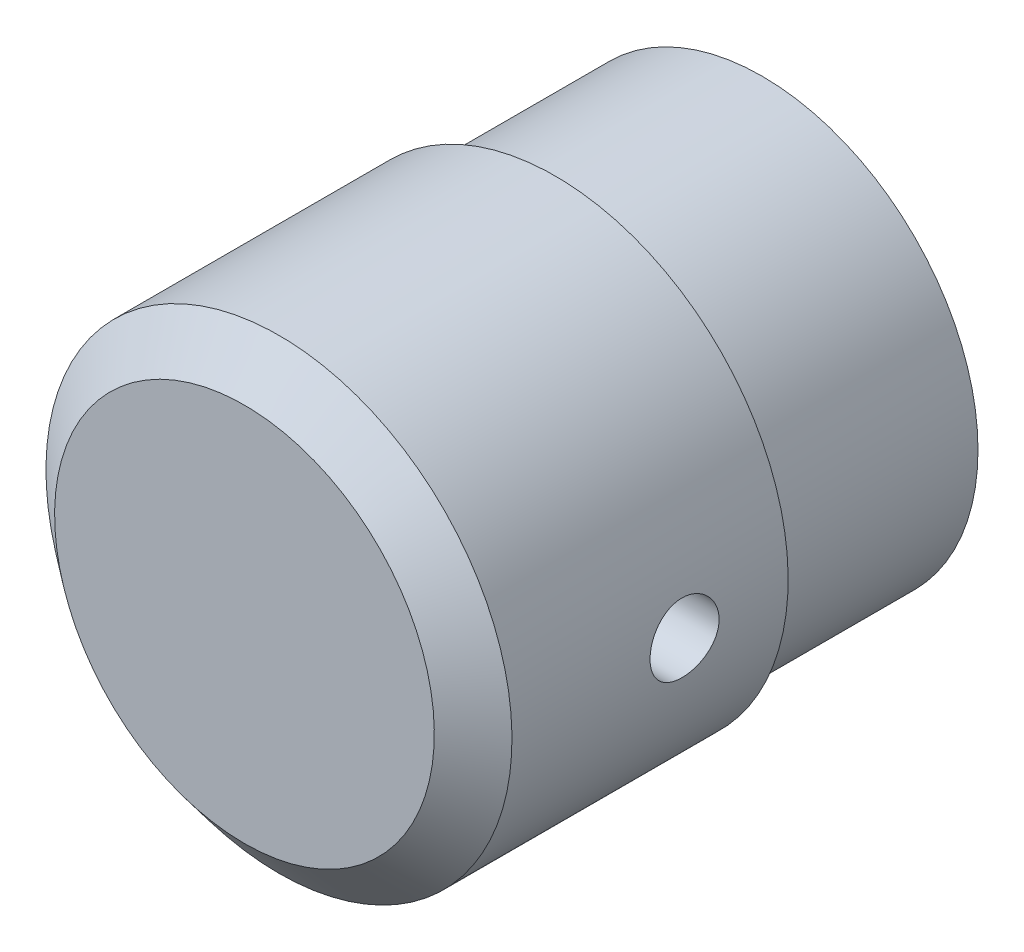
ISO-10303-21;
HEADER;
FILE_DESCRIPTION(('STEP AP214'),'2;1');
FILE_NAME('part.step','',(''),(''),'','','');
FILE_SCHEMA(('AUTOMOTIVE_DESIGN { 1 0 10303 214 1 1 1 1 }'));
ENDSEC;
DATA;
#1=APPLICATION_CONTEXT('core data for automotive mechanical design processes');
#2=APPLICATION_PROTOCOL_DEFINITION('international standard','automotive_design',2000,#1);
#3=PRODUCT_CONTEXT('',#1,'mechanical');
#4=PRODUCT('Part','Part','',(#3));
#5=PRODUCT_RELATED_PRODUCT_CATEGORY('part','',(#4));
#6=PRODUCT_DEFINITION_FORMATION('','',#4);
#7=PRODUCT_DEFINITION_CONTEXT('part definition',#1,'design');
#8=PRODUCT_DEFINITION('design','',#6,#7);
#9=PRODUCT_DEFINITION_SHAPE('','',#8);
#10=(LENGTH_UNIT() NAMED_UNIT(*) SI_UNIT(.MILLI.,.METRE.));
#11=(NAMED_UNIT(*) PLANE_ANGLE_UNIT() SI_UNIT($,.RADIAN.));
#12=(NAMED_UNIT(*) SI_UNIT($,.STERADIAN.) SOLID_ANGLE_UNIT());
#13=UNCERTAINTY_MEASURE_WITH_UNIT(LENGTH_MEASURE(1.E-05),#10,'distance_accuracy_value','');
#14=(GEOMETRIC_REPRESENTATION_CONTEXT(3) GLOBAL_UNCERTAINTY_ASSIGNED_CONTEXT((#13)) GLOBAL_UNIT_ASSIGNED_CONTEXT((#10,
#11,#12)) REPRESENTATION_CONTEXT('',''));
#15=CARTESIAN_POINT('',(0.,0.,0.));
#16=DIRECTION('',(0.,0.,1.));
#17=DIRECTION('',(1.,0.,0.));
#18=AXIS2_PLACEMENT_3D('',#15,#16,#17);
#19=CARTESIAN_POINT('',(0.,0.,-7.16785252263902));
#20=DIRECTION('',(0.,0.,-1.));
#21=DIRECTION('',(0.,-1.,0.));
#22=AXIS2_PLACEMENT_3D('',#19,#20,#21);
#23=CYLINDRICAL_SURFACE('',#22,13.5);
#24=CARTESIAN_POINT('',(0.,0.,12.));
#25=DIRECTION('',(0.,0.,-1.));
#26=DIRECTION('',(0.,-1.,0.));
#27=AXIS2_PLACEMENT_3D('',#24,#25,#26);
#28=CIRCLE('',#27,13.5);
#29=CARTESIAN_POINT('',(0.,-13.5,12.));
#30=VERTEX_POINT('',#29);
#31=EDGE_CURVE('E29',#30,#30,#28,.T.);
#32=ORIENTED_EDGE('',*,*,#31,.F.);
#33=EDGE_LOOP('',(#32));
#34=FACE_BOUND('',#33,.T.);
#35=CARTESIAN_POINT('',(0.,0.,28.));
#36=DIRECTION('',(0.,0.,-1.));
#37=DIRECTION('',(0.,-1.,0.));
#38=AXIS2_PLACEMENT_3D('',#35,#36,#37);
#39=CIRCLE('',#38,13.5);
#40=CARTESIAN_POINT('',(0.,-13.5,28.));
#41=VERTEX_POINT('',#40);
#42=EDGE_CURVE('E25',#41,#41,#39,.T.);
#43=ORIENTED_EDGE('',*,*,#42,.T.);
#44=EDGE_LOOP('',(#43));
#45=FACE_BOUND('',#44,.T.);
#46=CARTESIAN_POINT('',(13.3510299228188,2.,18.));
#47=CARTESIAN_POINT('',(13.3510317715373,1.99999537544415,17.8883225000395));
#48=CARTESIAN_POINT('',(13.3524463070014,1.99061447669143,17.7765797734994));
#49=CARTESIAN_POINT('',(13.3579479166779,1.95334804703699,17.5562173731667));
#50=CARTESIAN_POINT('',(13.3620376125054,1.9254443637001,17.447600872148));
#51=CARTESIAN_POINT('',(13.3724163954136,1.85198451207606,17.2367125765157));
#52=CARTESIAN_POINT('',(13.3787038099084,1.80644176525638,17.1344360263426));
#53=CARTESIAN_POINT('',(13.3927676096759,1.69902796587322,16.938991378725));
#54=CARTESIAN_POINT('',(13.4005437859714,1.63715920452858,16.8458220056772));
#55=CARTESIAN_POINT('',(13.4167768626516,1.49833330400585,16.6704937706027));
#56=CARTESIAN_POINT('',(13.4252381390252,1.4212737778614,16.5884163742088));
#57=CARTESIAN_POINT('',(13.4418489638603,1.2544748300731,16.4383077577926));
#58=CARTESIAN_POINT('',(13.4499984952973,1.16473471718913,16.3702773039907));
#59=CARTESIAN_POINT('',(13.4651133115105,0.974600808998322,16.2498937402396));
#60=CARTESIAN_POINT('',(13.4720728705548,0.874159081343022,16.1976155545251));
#61=CARTESIAN_POINT('',(13.4839751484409,0.665800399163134,16.1107012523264));
#62=CARTESIAN_POINT('',(13.4889179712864,0.557883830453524,16.0760642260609));
#63=CARTESIAN_POINT('',(13.4961989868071,0.338477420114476,16.0256621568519));
#64=CARTESIAN_POINT('',(13.4985559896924,0.227019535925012,16.0097607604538));
#65=CARTESIAN_POINT('',(13.500464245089,0.00299429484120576,15.996858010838));
#66=CARTESIAN_POINT('',(13.5000156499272,-0.109573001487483,15.9998556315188));
#67=CARTESIAN_POINT('',(13.4963782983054,-0.331691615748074,16.0245580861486));
#68=CARTESIAN_POINT('',(13.4932110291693,-0.441259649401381,16.0461162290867));
#69=CARTESIAN_POINT('',(13.4845161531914,-0.655205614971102,16.1070975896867));
#70=CARTESIAN_POINT('',(13.4789884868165,-0.759583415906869,16.1465212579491));
#71=CARTESIAN_POINT('',(13.4661569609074,-0.960630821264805,16.2422652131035));
#72=CARTESIAN_POINT('',(13.4588466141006,-1.05727052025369,16.2986473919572));
#73=CARTESIAN_POINT('',(13.4432647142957,-1.23977237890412,16.4266627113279));
#74=CARTESIAN_POINT('',(13.4349930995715,-1.32563384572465,16.4982968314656));
#75=CARTESIAN_POINT('',(13.4183177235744,-1.48500641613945,16.655600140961));
#76=CARTESIAN_POINT('',(13.4099134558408,-1.55839113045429,16.7413973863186));
#77=CARTESIAN_POINT('',(13.3939974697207,-1.6897405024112,16.9241560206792));
#78=CARTESIAN_POINT('',(13.3864857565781,-1.74770506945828,17.0211174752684));
#79=CARTESIAN_POINT('',(13.3732055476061,-1.84658503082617,17.2235823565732));
#80=CARTESIAN_POINT('',(13.3674383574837,-1.88748766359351,17.32909210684));
#81=CARTESIAN_POINT('',(13.3583234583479,-1.95095673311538,17.5455881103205));
#82=CARTESIAN_POINT('',(13.3549755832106,-1.97352442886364,17.6565739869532));
#83=CARTESIAN_POINT('',(13.3511097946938,-1.99951014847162,17.8797479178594));
#84=CARTESIAN_POINT('',(13.3505654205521,-2.00310723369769,17.9919146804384));
#85=CARTESIAN_POINT('',(13.3522980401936,-1.99152454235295,18.2152494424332));
#86=CARTESIAN_POINT('',(13.3545749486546,-1.9763453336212,18.3264174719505));
#87=CARTESIAN_POINT('',(13.3616692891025,-1.92779271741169,18.5440458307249));
#88=CARTESIAN_POINT('',(13.3664742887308,-1.89450831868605,18.6505264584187));
#89=CARTESIAN_POINT('',(13.3780731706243,-1.81078265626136,18.8563971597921));
#90=CARTESIAN_POINT('',(13.3848671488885,-1.76034056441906,18.9557868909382));
#91=CARTESIAN_POINT('',(13.3997409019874,-1.64330036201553,19.1454577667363));
#92=CARTESIAN_POINT('',(13.4078297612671,-1.57658621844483,19.2356665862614));
#93=CARTESIAN_POINT('',(13.4243544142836,-1.42905720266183,19.4036718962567));
#94=CARTESIAN_POINT('',(13.4327902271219,-1.34824155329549,19.4814677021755));
#95=CARTESIAN_POINT('',(13.4491408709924,-1.17401551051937,19.6230805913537));
#96=CARTESIAN_POINT('',(13.457050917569,-1.0805082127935,19.6867790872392));
#97=CARTESIAN_POINT('',(13.4713846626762,-0.884016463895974,19.7975634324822));
#98=CARTESIAN_POINT('',(13.4778084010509,-0.781032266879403,19.8446497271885));
#99=CARTESIAN_POINT('',(13.4884247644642,-0.568882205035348,19.9206830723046));
#100=CARTESIAN_POINT('',(13.4926253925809,-0.459740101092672,19.9496952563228));
#101=CARTESIAN_POINT('',(13.4983558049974,-0.238066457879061,19.9889677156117));
#102=CARTESIAN_POINT('',(13.4998857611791,-0.125535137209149,19.9992291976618));
#103=CARTESIAN_POINT('',(13.5001007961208,0.0985718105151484,20.0006800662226));
#104=CARTESIAN_POINT('',(13.4988129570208,0.210146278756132,19.9920510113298));
#105=CARTESIAN_POINT('',(13.4935916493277,0.430239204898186,19.9563545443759));
#106=CARTESIAN_POINT('',(13.4896581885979,0.538757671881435,19.9292871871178));
#107=CARTESIAN_POINT('',(13.4795855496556,0.749610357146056,19.8575462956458));
#108=CARTESIAN_POINT('',(13.4734479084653,0.851948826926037,19.8128850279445));
#109=CARTESIAN_POINT('',(13.4596414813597,1.04770796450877,19.7072433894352));
#110=CARTESIAN_POINT('',(13.4519726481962,1.1411283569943,19.646262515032));
#111=CARTESIAN_POINT('',(13.4358689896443,1.31732093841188,19.5090549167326));
#112=CARTESIAN_POINT('',(13.4274278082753,1.39998808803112,19.432694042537));
#113=CARTESIAN_POINT('',(13.4107781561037,1.55140152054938,19.2671762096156));
#114=CARTESIAN_POINT('',(13.402569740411,1.62014453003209,19.1780162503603));
#115=CARTESIAN_POINT('',(13.3872668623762,1.74209505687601,18.9888583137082));
#116=CARTESIAN_POINT('',(13.3801787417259,1.79521550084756,18.8888036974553));
#117=CARTESIAN_POINT('',(13.36799332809,1.88381847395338,18.6811354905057));
#118=CARTESIAN_POINT('',(13.3628939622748,1.91931937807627,18.5735299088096));
#119=CARTESIAN_POINT('',(13.3564464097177,1.96358296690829,18.3878624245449));
#120=CARTESIAN_POINT('',(13.3544259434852,1.97721856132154,18.3109493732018));
#121=CARTESIAN_POINT('',(13.3517170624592,1.99542863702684,18.156034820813));
#122=CARTESIAN_POINT('',(13.3510286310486,2.00000323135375,18.0780333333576));
#123=CARTESIAN_POINT('',(13.3510299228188,2.,18.));
#124=B_SPLINE_CURVE_WITH_KNOTS('',3,(#46,#47,#48,#49,#50,#51,#52,#53,#54,#55,#56,#57,#58,#59,
#60,#61,#62,#63,#64,#65,#66,#67,#68,#69,#70,#71,#72,#73,#74,#75,#76,#77,#78,#79,#80,#81,#82,#83,
#84,#85,#86,#87,#88,#89,#90,#91,#92,#93,#94,#95,#96,#97,#98,#99,#100,#101,#102,#103,#104,#105,
#106,#107,#108,#109,#110,#111,#112,#113,#114,#115,#116,#117,#118,#119,#120,#121,#122,#123),
.UNSPECIFIED.,.T.,.F.,(4,2,2,2,2,2,2,2,2,2,2,2,2,2,2,2,2,2,2,2,2,2,2,2,2,2,2,2,2,2,2,2,2,2,2,2,
2,2,4),(0.,0.334747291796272,0.669823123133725,1.00464449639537,1.33941890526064,
1.67653202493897,2.01366352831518,2.35237413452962,2.6910672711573,3.02727994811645,
3.36347437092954,3.69703585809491,4.0306057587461,4.3654081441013,4.70023204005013,
5.0382681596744,5.37630626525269,5.71459675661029,6.05286401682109,6.38793262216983,
6.7229910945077,7.0564170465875,7.38985909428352,7.72575218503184,8.06166379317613,
8.40030191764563,8.73893096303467,9.07633252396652,9.41371236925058,9.74786387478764,
10.0820143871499,10.4159323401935,10.7498605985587,11.0868385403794,11.4238956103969,
11.762797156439,12.1013445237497,12.3352481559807,12.5691488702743),.UNSPECIFIED.);
#125=CARTESIAN_POINT('',(13.3510299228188,2.,18.));
#126=VERTEX_POINT('',#125);
#127=EDGE_CURVE('E49',#126,#126,#124,.T.);
#128=ORIENTED_EDGE('',*,*,#127,.T.);
#129=EDGE_LOOP('',(#128));
#130=FACE_BOUND('',#129,.T.);
#131=ADVANCED_FACE('F12',(#34,#45,#130),#23,.T.);
#132=CARTESIAN_POINT('',(0.,0.,26.));
#133=DIRECTION('',(0.,0.,-1.));
#134=DIRECTION('',(0.,-1.,0.));
#135=AXIS2_PLACEMENT_3D('',#132,#133,#134);
#136=CYLINDRICAL_SURFACE('',#135,3.);
#137=CARTESIAN_POINT('',(0.,0.,24.));
#138=DIRECTION('',(0.,0.,-1.));
#139=DIRECTION('',(-1.,0.,0.));
#140=AXIS2_PLACEMENT_3D('',#137,#138,#139);
#141=CIRCLE('',#140,3.);
#142=CARTESIAN_POINT('',(-3.,0.,24.));
#143=VERTEX_POINT('',#142);
#144=EDGE_CURVE('E56',#143,#143,#141,.T.);
#145=ORIENTED_EDGE('',*,*,#144,.F.);
#146=EDGE_LOOP('',(#145));
#147=FACE_BOUND('',#146,.T.);
#148=CARTESIAN_POINT('',(0.,0.,12.));
#149=DIRECTION('',(0.,0.,-1.));
#150=DIRECTION('',(0.,-1.,0.));
#151=AXIS2_PLACEMENT_3D('',#148,#149,#150);
#152=CIRCLE('',#151,3.);
#153=CARTESIAN_POINT('',(0.,-3.,12.));
#154=VERTEX_POINT('',#153);
#155=EDGE_CURVE('E46',#154,#154,#152,.T.);
#156=ORIENTED_EDGE('',*,*,#155,.T.);
#157=EDGE_LOOP('',(#156));
#158=FACE_BOUND('',#157,.T.);
#159=CARTESIAN_POINT('',(2.23606797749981,2.,18.));
#160=CARTESIAN_POINT('',(2.23607753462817,1.99999453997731,17.9023716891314));
#161=CARTESIAN_POINT('',(2.24258071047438,1.99278992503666,17.8047092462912));
#162=CARTESIAN_POINT('',(2.26731972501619,1.96458268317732,17.6128800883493));
#163=CARTESIAN_POINT('',(2.28557660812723,1.9435553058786,17.5187199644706));
#164=CARTESIAN_POINT('',(2.33056585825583,1.88935861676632,17.3372645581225));
#165=CARTESIAN_POINT('',(2.35721561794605,1.85630718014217,17.2499123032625));
#166=CARTESIAN_POINT('',(2.41584094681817,1.77934008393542,17.0821341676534));
#167=CARTESIAN_POINT('',(2.4478176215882,1.73542216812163,17.0017097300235));
#168=CARTESIAN_POINT('',(2.51946072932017,1.63002410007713,16.8363531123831));
#169=CARTESIAN_POINT('',(2.55954936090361,1.56687435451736,16.7526678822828));
#170=CARTESIAN_POINT('',(2.63944827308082,1.42819219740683,16.5959972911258));
#171=CARTESIAN_POINT('',(2.6792582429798,1.35264773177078,16.5230224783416));
#172=CARTESIAN_POINT('',(2.76088818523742,1.17815690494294,16.3793563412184));
#173=CARTESIAN_POINT('',(2.80216785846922,1.07740643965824,16.3105174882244));
#174=CARTESIAN_POINT('',(2.87558484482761,0.862470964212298,16.1913579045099));
#175=CARTESIAN_POINT('',(2.90773236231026,0.74830115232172,16.1410164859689));
#176=CARTESIAN_POINT('',(2.95599907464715,0.523249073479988,16.0664435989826));
#177=CARTESIAN_POINT('',(2.97351175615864,0.413434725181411,16.0399166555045));
#178=CARTESIAN_POINT('',(2.99609745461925,0.189695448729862,16.0058155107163));
#179=CARTESIAN_POINT('',(3.00118613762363,0.0757758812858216,15.9982174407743));
#180=CARTESIAN_POINT('',(2.99855361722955,-0.134147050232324,16.0021724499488));
#181=CARTESIAN_POINT('',(2.99266264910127,-0.230240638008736,16.010989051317));
#182=CARTESIAN_POINT('',(2.97208182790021,-0.419238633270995,16.042091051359));
#183=CARTESIAN_POINT('',(2.95739133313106,-0.51214280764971,16.0643774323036));
#184=CARTESIAN_POINT('',(2.9205209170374,-0.692077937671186,16.1211956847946));
#185=CARTESIAN_POINT('',(2.89837077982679,-0.779130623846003,16.1556788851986));
#186=CARTESIAN_POINT('',(2.84821104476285,-0.946209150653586,16.2355536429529));
#187=CARTESIAN_POINT('',(2.82020037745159,-1.0262337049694,16.2809471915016));
#188=CARTESIAN_POINT('',(2.75618058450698,-1.18828429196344,16.38797873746));
#189=CARTESIAN_POINT('',(2.71960408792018,-1.26919148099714,16.4509675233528));
#190=CARTESIAN_POINT('',(2.64400601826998,-1.41998807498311,16.5878986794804));
#191=CARTESIAN_POINT('',(2.60498072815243,-1.48986013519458,16.661857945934));
#192=CARTESIAN_POINT('',(2.52150044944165,-1.62772235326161,16.8319632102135));
#193=CARTESIAN_POINT('',(2.47714320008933,-1.69373593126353,16.9297710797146));
#194=CARTESIAN_POINT('',(2.39475610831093,-1.80834874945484,17.1375098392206));
#195=CARTESIAN_POINT('',(2.35671571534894,-1.85697718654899,17.2474199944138));
#196=CARTESIAN_POINT('',(2.30262870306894,-1.92332724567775,17.444719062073));
#197=CARTESIAN_POINT('',(2.28340364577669,-1.9459079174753,17.5295933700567));
#198=CARTESIAN_POINT('',(2.25409039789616,-1.97979555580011,17.7030394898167));
#199=CARTESIAN_POINT('',(2.24398636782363,-1.99112206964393,17.7916046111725));
#200=CARTESIAN_POINT('',(2.23447556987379,-2.00179400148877,17.9704429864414));
#201=CARTESIAN_POINT('',(2.2351153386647,-2.00108729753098,18.06072197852));
#202=CARTESIAN_POINT('',(2.24709880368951,-1.98761629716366,18.239683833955));
#203=CARTESIAN_POINT('',(2.25845117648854,-1.97484222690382,18.3283653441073));
#204=CARTESIAN_POINT('',(2.28927977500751,-1.93899811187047,18.4973894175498));
#205=CARTESIAN_POINT('',(2.3083318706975,-1.91646174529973,18.5779277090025));
#206=CARTESIAN_POINT('',(2.35229958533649,-1.86223041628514,18.7341262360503));
#207=CARTESIAN_POINT('',(2.3772171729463,-1.83053237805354,18.809784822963));
#208=CARTESIAN_POINT('',(2.43611483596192,-1.75163346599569,18.9702020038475));
#209=CARTESIAN_POINT('',(2.4709108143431,-1.70260028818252,19.0537568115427));
#210=CARTESIAN_POINT('',(2.54262514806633,-1.59352731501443,19.2124168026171));
#211=CARTESIAN_POINT('',(2.57954604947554,-1.53347411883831,19.2875115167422));
#212=CARTESIAN_POINT('',(2.66075678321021,-1.38876657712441,19.4439623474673));
#213=CARTESIAN_POINT('',(2.70489452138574,-1.30160386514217,19.5231028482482));
#214=CARTESIAN_POINT('',(2.78775581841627,-1.11309948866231,19.6658166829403));
#215=CARTESIAN_POINT('',(2.82648414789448,-1.01177047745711,19.7294037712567));
#216=CARTESIAN_POINT('',(2.88790821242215,-0.817487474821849,19.8278917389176));
#217=CARTESIAN_POINT('',(2.91225458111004,-0.726662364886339,19.8659565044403));
#218=CARTESIAN_POINT('',(2.95278707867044,-0.538757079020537,19.9286071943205));
#219=CARTESIAN_POINT('',(2.96898009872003,-0.44168226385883,19.95320450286));
#220=CARTESIAN_POINT('',(2.99178364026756,-0.243369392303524,19.987696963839));
#221=CARTESIAN_POINT('',(2.99835150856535,-0.142114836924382,19.9975266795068));
#222=CARTESIAN_POINT('',(3.00109821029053,0.0608555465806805,20.001647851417));
#223=CARTESIAN_POINT('',(2.99727800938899,0.162571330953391,19.995940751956));
#224=CARTESIAN_POINT('',(2.98029555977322,0.355757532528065,19.9703405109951));
#225=CARTESIAN_POINT('',(2.96783277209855,0.447435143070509,19.9515090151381));
#226=CARTESIAN_POINT('',(2.93536106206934,0.626018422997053,19.9017619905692));
#227=CARTESIAN_POINT('',(2.91535096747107,0.712923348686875,19.8708445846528));
#228=CARTESIAN_POINT('',(2.86791765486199,0.885147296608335,19.7960612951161));
#229=CARTESIAN_POINT('',(2.84013248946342,0.970083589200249,19.751549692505));
#230=CARTESIAN_POINT('',(2.7797540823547,1.13155266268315,19.651849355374));
#231=CARTESIAN_POINT('',(2.74715796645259,1.20808037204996,19.5966542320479));
#232=CARTESIAN_POINT('',(2.67392931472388,1.36329422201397,19.4673710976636));
#233=CARTESIAN_POINT('',(2.63283913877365,1.44042679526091,19.3916769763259));
#234=CARTESIAN_POINT('',(2.55053357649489,1.58160022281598,19.2288864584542));
#235=CARTESIAN_POINT('',(2.50931811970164,1.64563128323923,19.1417816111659));
#236=CARTESIAN_POINT('',(2.43384213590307,1.7551325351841,18.9641324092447));
#237=CARTESIAN_POINT('',(2.39929086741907,1.8016464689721,18.8743581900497));
#238=CARTESIAN_POINT('',(2.33747501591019,1.88115802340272,18.6867155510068));
#239=CARTESIAN_POINT('',(2.31019631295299,1.91418190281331,18.5888633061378));
#240=CARTESIAN_POINT('',(2.27191051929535,1.95936262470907,18.4092285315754));
#241=CARTESIAN_POINT('',(2.25863695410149,1.97452228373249,18.3286917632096));
#242=CARTESIAN_POINT('',(2.2407151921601,1.99483915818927,18.1654435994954));
#243=CARTESIAN_POINT('',(2.23605987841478,2.00000462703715,18.0827340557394));
#244=CARTESIAN_POINT('',(2.23606797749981,2.,18.));
#245=B_SPLINE_CURVE_WITH_KNOTS('',3,(#159,#160,#161,#162,#163,#164,#165,#166,#167,#168,#169,
#170,#171,#172,#173,#174,#175,#176,#177,#178,#179,#180,#181,#182,#183,#184,#185,#186,#187,#188,
#189,#190,#191,#192,#193,#194,#195,#196,#197,#198,#199,#200,#201,#202,#203,#204,#205,#206,#207,
#208,#209,#210,#211,#212,#213,#214,#215,#216,#217,#218,#219,#220,#221,#222,#223,#224,#225,#226,
#227,#228,#229,#230,#231,#232,#233,#234,#235,#236,#237,#238,#239,#240,#241,#242,#243,#244),
.UNSPECIFIED.,.T.,.F.,(4,2,2,2,2,2,2,2,2,2,2,2,2,2,2,2,2,2,2,2,2,2,2,2,2,2,2,2,2,2,2,2,2,2,2,2,
2,2,2,2,2,2,4),(0.,0.292506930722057,0.585539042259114,0.875772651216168,1.16606657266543,
1.5015467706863,1.83735518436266,2.22167031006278,2.6055542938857,2.94637482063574,
3.28676536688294,3.57539534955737,3.86404638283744,4.15155831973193,4.43912276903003,
4.7644752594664,5.09033414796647,5.46678703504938,5.84260469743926,6.11126090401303,
6.37944966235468,6.6488003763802,6.91836943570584,7.17476451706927,7.43124577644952,
7.73899230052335,8.04711556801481,8.42254684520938,8.79764490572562,9.10070580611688,
9.40351012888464,9.70765229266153,10.0117661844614,10.2937678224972,10.5758132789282,
10.8741786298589,11.1727229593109,11.5182220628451,11.8639785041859,12.1833412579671,
12.5020793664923,12.7501661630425,12.9980479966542),.UNSPECIFIED.);
#246=CARTESIAN_POINT('',(2.23606797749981,2.,18.));
#247=VERTEX_POINT('',#246);
#248=EDGE_CURVE('E16',#247,#247,#245,.T.);
#249=ORIENTED_EDGE('',*,*,#248,.F.);
#250=EDGE_LOOP('',(#249));
#251=FACE_BOUND('',#250,.T.);
#252=ADVANCED_FACE('F66',(#147,#158,#251),#136,.F.);
#253=CARTESIAN_POINT('',(11.,0.,30.));
#254=DIRECTION('',(0.,0.,1.));
#255=DIRECTION('',(0.,1.,0.));
#256=AXIS2_PLACEMENT_3D('',#253,#254,#255);
#257=PLANE('',#256);
#258=CARTESIAN_POINT('',(0.,0.,30.));
#259=DIRECTION('',(0.,0.,-1.));
#260=DIRECTION('',(0.,-1.,0.));
#261=AXIS2_PLACEMENT_3D('',#258,#259,#260);
#262=CIRCLE('',#261,11.);
#263=CARTESIAN_POINT('',(0.,-11.,30.));
#264=VERTEX_POINT('',#263);
#265=EDGE_CURVE('E8',#264,#264,#262,.T.);
#266=ORIENTED_EDGE('',*,*,#265,.F.);
#267=EDGE_LOOP('',(#266));
#268=FACE_BOUND('',#267,.T.);
#269=ADVANCED_FACE('F14',(#268),#257,.T.);
#270=CARTESIAN_POINT('',(0.,0.,30.));
#271=DIRECTION('',(0.,0.,-1.));
#272=DIRECTION('',(0.,-1.,0.));
#273=AXIS2_PLACEMENT_3D('',#270,#271,#272);
#274=CONICAL_SURFACE('',#273,11.,0.896055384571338);
#275=ORIENTED_EDGE('',*,*,#42,.F.);
#276=EDGE_LOOP('',(#275));
#277=FACE_BOUND('',#276,.T.);
#278=ORIENTED_EDGE('',*,*,#265,.T.);
#279=EDGE_LOOP('',(#278));
#280=FACE_BOUND('',#279,.T.);
#281=ADVANCED_FACE('F88',(#277,#280),#274,.T.);
#282=CARTESIAN_POINT('',(12.5,0.,12.));
#283=DIRECTION('',(0.,0.,-1.));
#284=DIRECTION('',(0.,-1.,0.));
#285=AXIS2_PLACEMENT_3D('',#282,#283,#284);
#286=PLANE('',#285);
#287=ORIENTED_EDGE('',*,*,#31,.T.);
#288=EDGE_LOOP('',(#287));
#289=FACE_BOUND('',#288,.T.);
#290=CARTESIAN_POINT('',(0.,0.,12.));
#291=DIRECTION('',(0.,0.,-1.));
#292=DIRECTION('',(0.,-1.,0.));
#293=AXIS2_PLACEMENT_3D('',#290,#291,#292);
#294=CIRCLE('',#293,12.5);
#295=CARTESIAN_POINT('',(0.,-12.5,12.));
#296=VERTEX_POINT('',#295);
#297=EDGE_CURVE('E34',#296,#296,#294,.T.);
#298=ORIENTED_EDGE('',*,*,#297,.F.);
#299=EDGE_LOOP('',(#298));
#300=FACE_BOUND('',#299,.T.);
#301=ADVANCED_FACE('F85',(#289,#300),#286,.T.);
#302=CARTESIAN_POINT('',(0.,0.,-7.16785252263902));
#303=DIRECTION('',(0.,0.,-1.));
#304=DIRECTION('',(0.,-1.,0.));
#305=AXIS2_PLACEMENT_3D('',#302,#303,#304);
#306=CYLINDRICAL_SURFACE('',#305,12.5);
#307=CARTESIAN_POINT('',(0.,0.,0.));
#308=DIRECTION('',(0.,0.,-1.));
#309=DIRECTION('',(0.,-1.,0.));
#310=AXIS2_PLACEMENT_3D('',#307,#308,#309);
#311=CIRCLE('',#310,12.5);
#312=CARTESIAN_POINT('',(0.,-12.5,0.));
#313=VERTEX_POINT('',#312);
#314=EDGE_CURVE('E37',#313,#313,#311,.T.);
#315=ORIENTED_EDGE('',*,*,#314,.F.);
#316=EDGE_LOOP('',(#315));
#317=FACE_BOUND('',#316,.T.);
#318=ORIENTED_EDGE('',*,*,#297,.T.);
#319=EDGE_LOOP('',(#318));
#320=FACE_BOUND('',#319,.T.);
#321=ADVANCED_FACE('F82',(#317,#320),#306,.T.);
#322=CARTESIAN_POINT('',(12.5,0.,0.));
#323=DIRECTION('',(0.,0.,1.));
#324=DIRECTION('',(0.,1.,0.));
#325=AXIS2_PLACEMENT_3D('',#322,#323,#324);
#326=PLANE('',#325);
#327=CARTESIAN_POINT('',(0.,0.,0.));
#328=DIRECTION('',(0.,0.,-1.));
#329=DIRECTION('',(0.,-1.,0.));
#330=AXIS2_PLACEMENT_3D('',#327,#328,#329);
#331=CIRCLE('',#330,11.);
#332=CARTESIAN_POINT('',(0.,-11.,0.));
#333=VERTEX_POINT('',#332);
#334=EDGE_CURVE('E40',#333,#333,#331,.T.);
#335=ORIENTED_EDGE('',*,*,#334,.F.);
#336=EDGE_LOOP('',(#335));
#337=FACE_BOUND('',#336,.T.);
#338=ORIENTED_EDGE('',*,*,#314,.T.);
#339=EDGE_LOOP('',(#338));
#340=FACE_BOUND('',#339,.T.);
#341=ADVANCED_FACE('F78',(#337,#340),#326,.F.);
#342=CARTESIAN_POINT('',(0.,0.,-7.16785252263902));
#343=DIRECTION('',(0.,0.,-1.));
#344=DIRECTION('',(0.,-1.,0.));
#345=AXIS2_PLACEMENT_3D('',#342,#343,#344);
#346=CYLINDRICAL_SURFACE('',#345,11.);
#347=CARTESIAN_POINT('',(0.,0.,12.));
#348=DIRECTION('',(0.,0.,-1.));
#349=DIRECTION('',(0.,-1.,0.));
#350=AXIS2_PLACEMENT_3D('',#347,#348,#349);
#351=CIRCLE('',#350,11.);
#352=CARTESIAN_POINT('',(0.,-11.,12.));
#353=VERTEX_POINT('',#352);
#354=EDGE_CURVE('E43',#353,#353,#351,.T.);
#355=ORIENTED_EDGE('',*,*,#354,.F.);
#356=EDGE_LOOP('',(#355));
#357=FACE_BOUND('',#356,.T.);
#358=ORIENTED_EDGE('',*,*,#334,.T.);
#359=EDGE_LOOP('',(#358));
#360=FACE_BOUND('',#359,.T.);
#361=ADVANCED_FACE('F74',(#357,#360),#346,.F.);
#362=CARTESIAN_POINT('',(0.,0.,12.));
#363=DIRECTION('',(0.,0.,-1.));
#364=DIRECTION('',(0.,-1.,0.));
#365=AXIS2_PLACEMENT_3D('',#362,#363,#364);
#366=PLANE('',#365);
#367=ORIENTED_EDGE('',*,*,#155,.F.);
#368=EDGE_LOOP('',(#367));
#369=FACE_BOUND('',#368,.T.);
#370=ORIENTED_EDGE('',*,*,#354,.T.);
#371=EDGE_LOOP('',(#370));
#372=FACE_BOUND('',#371,.T.);
#373=ADVANCED_FACE('F64',(#369,#372),#366,.T.);
#374=CARTESIAN_POINT('',(1.40000000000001,0.,18.));
#375=DIRECTION('',(1.,0.,0.));
#376=DIRECTION('',(0.,1.,0.));
#377=AXIS2_PLACEMENT_3D('',#374,#375,#376);
#378=CYLINDRICAL_SURFACE('',#377,2.);
#379=ORIENTED_EDGE('',*,*,#127,.F.);
#380=EDGE_LOOP('',(#379));
#381=FACE_BOUND('',#380,.T.);
#382=ORIENTED_EDGE('',*,*,#248,.T.);
#383=EDGE_LOOP('',(#382));
#384=FACE_BOUND('',#383,.T.);
#385=ADVANCED_FACE('F59',(#381,#384),#378,.F.);
#386=CARTESIAN_POINT('',(0.,0.,24.));
#387=DIRECTION('',(0.,0.,-1.));
#388=DIRECTION('',(-1.,0.,0.));
#389=AXIS2_PLACEMENT_3D('',#386,#387,#388);
#390=PLANE('',#389);
#391=ORIENTED_EDGE('',*,*,#144,.T.);
#392=EDGE_LOOP('',(#391));
#393=FACE_BOUND('',#392,.T.);
#394=ADVANCED_FACE('F63',(#393),#390,.T.);
#395=CLOSED_SHELL('',(#131,#252,#269,#281,#301,#321,#341,#361,#373,#385,#394));
#396=MANIFOLD_SOLID_BREP('B1',#395);
#397=ADVANCED_BREP_SHAPE_REPRESENTATION('',(#18,#396),#14);
#398=SHAPE_DEFINITION_REPRESENTATION(#9,#397);
ENDSEC;
END-ISO-10303-21;
